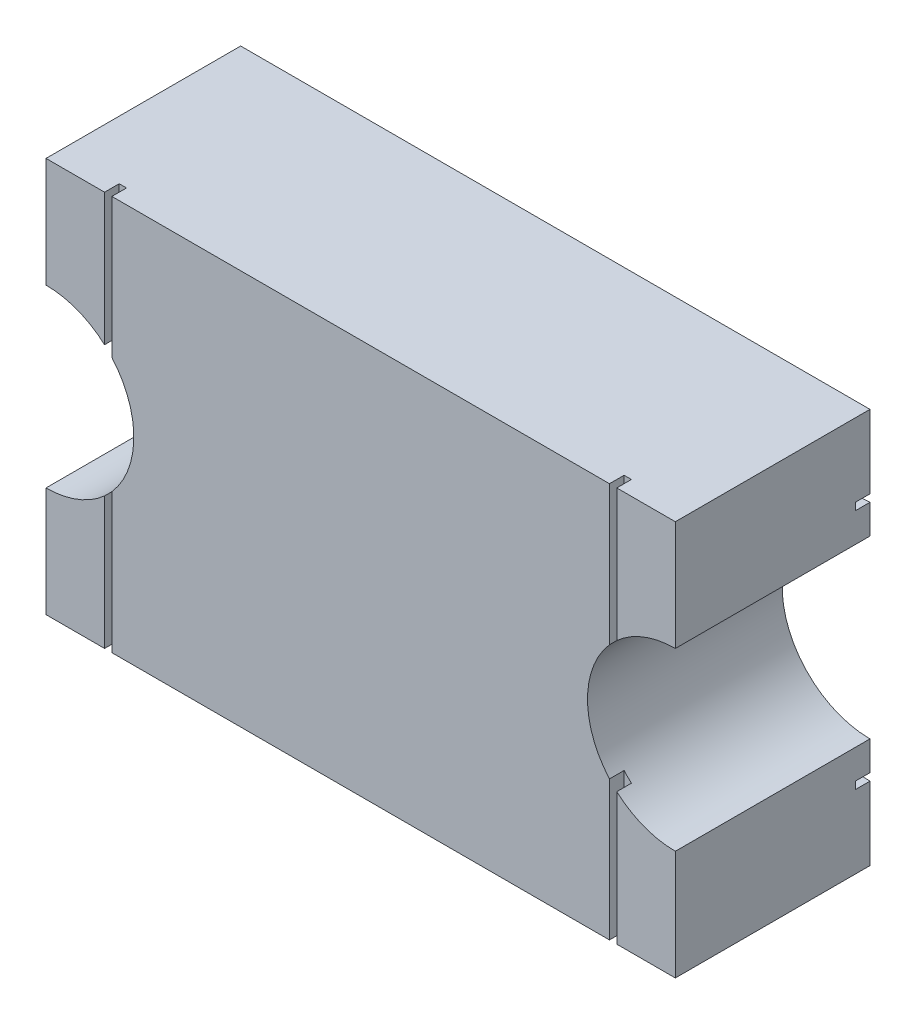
ISO-10303-21;
HEADER;
FILE_DESCRIPTION(('STEP AP214'),'2;1');
FILE_NAME('part.step','',(''),(''),'','','');
FILE_SCHEMA(('AUTOMOTIVE_DESIGN { 1 0 10303 214 1 1 1 1 }'));
ENDSEC;
DATA;
#1=APPLICATION_CONTEXT('core data for automotive mechanical design processes');
#2=APPLICATION_PROTOCOL_DEFINITION('international standard','automotive_design',2000,#1);
#3=PRODUCT_CONTEXT('',#1,'mechanical');
#4=PRODUCT('Part','Part','',(#3));
#5=PRODUCT_RELATED_PRODUCT_CATEGORY('part','',(#4));
#6=PRODUCT_DEFINITION_FORMATION('','',#4);
#7=PRODUCT_DEFINITION_CONTEXT('part definition',#1,'design');
#8=PRODUCT_DEFINITION('design','',#6,#7);
#9=PRODUCT_DEFINITION_SHAPE('','',#8);
#10=(LENGTH_UNIT() NAMED_UNIT(*) SI_UNIT(.MILLI.,.METRE.));
#11=(NAMED_UNIT(*) PLANE_ANGLE_UNIT() SI_UNIT($,.RADIAN.));
#12=(NAMED_UNIT(*) SI_UNIT($,.STERADIAN.) SOLID_ANGLE_UNIT());
#13=UNCERTAINTY_MEASURE_WITH_UNIT(LENGTH_MEASURE(1.E-05),#10,'distance_accuracy_value','');
#14=(GEOMETRIC_REPRESENTATION_CONTEXT(3) GLOBAL_UNCERTAINTY_ASSIGNED_CONTEXT((#13)) GLOBAL_UNIT_ASSIGNED_CONTEXT((#10,
#11,#12)) REPRESENTATION_CONTEXT('',''));
#15=CARTESIAN_POINT('',(0.,0.,0.));
#16=DIRECTION('',(0.,0.,1.));
#17=DIRECTION('',(1.,0.,0.));
#18=AXIS2_PLACEMENT_3D('',#15,#16,#17);
#19=CARTESIAN_POINT('',(0.000121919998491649,4.06399994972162E-05,0.));
#20=DIRECTION('',(0.,-4.37113882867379E-08,0.999999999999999));
#21=DIRECTION('',(0.999999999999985,1.74845553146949E-07,0.));
#22=AXIS2_PLACEMENT_3D('',#19,#20,#21);
#23=PLANE('',#22);
#24=DIRECTION('',(-1.74845553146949E-07,0.999999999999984,4.37113882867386E-08));
#25=VECTOR('',#24,1.);
#26=CARTESIAN_POINT('',(1.07512203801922,-0.674959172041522,-2.95051870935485E-08));
#27=LINE('',#26,#25);
#28=CARTESIAN_POINT('',(1.07512203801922,-0.674959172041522,-2.95051870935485E-08));
#29=VERTEX_POINT('',#28);
#30=CARTESIAN_POINT('',(1.07512199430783,-0.424959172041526,-1.85773400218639E-08));
#31=VERTEX_POINT('',#30);
#32=EDGE_CURVE('E11',#29,#31,#27,.T.);
#33=ORIENTED_EDGE('',*,*,#32,.F.);
#34=DIRECTION('',(0.999999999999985,1.74845553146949E-07,0.));
#35=VECTOR('',#34,1.);
#36=CARTESIAN_POINT('',(-1.07487796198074,-0.674959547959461,-2.95051870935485E-08));
#37=LINE('',#36,#35);
#38=CARTESIAN_POINT('',(-1.07487796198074,-0.674959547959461,-2.95051870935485E-08));
#39=VERTEX_POINT('',#38);
#40=EDGE_CURVE('E24',#39,#29,#37,.T.);
#41=ORIENTED_EDGE('',*,*,#40,.F.);
#42=DIRECTION('',(1.74845553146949E-07,-0.999999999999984,-4.37113882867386E-08));
#43=VECTOR('',#42,1.);
#44=CARTESIAN_POINT('',(-1.07487800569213,-0.424959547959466,-1.85773400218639E-08));
#45=LINE('',#44,#43);
#46=CARTESIAN_POINT('',(-1.07487800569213,-0.424959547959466,-1.85773400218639E-08));
#47=VERTEX_POINT('',#46);
#48=EDGE_CURVE('E477',#47,#39,#45,.T.);
#49=ORIENTED_EDGE('',*,*,#48,.F.);
#50=CARTESIAN_POINT('',(-1.07487808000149,4.04520405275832E-05,0.));
#51=DIRECTION('',(0.,4.37113882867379E-08,-0.999999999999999));
#52=DIRECTION('',(-1.74845553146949E-07,0.999999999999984,4.37113882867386E-08));
#53=AXIS2_PLACEMENT_3D('',#50,#51,#52);
#54=CIRCLE('',#53,0.425);
#55=CARTESIAN_POINT('',(-1.07487815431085,0.425040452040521,1.85773400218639E-08));
#56=VERTEX_POINT('',#55);
#57=EDGE_CURVE('E475',#56,#47,#54,.T.);
#58=ORIENTED_EDGE('',*,*,#57,.F.);
#59=DIRECTION('',(1.74845553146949E-07,-0.999999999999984,-4.37113882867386E-08));
#60=VECTOR('',#59,1.);
#61=CARTESIAN_POINT('',(-1.07487819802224,0.675040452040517,2.95051870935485E-08));
#62=LINE('',#61,#60);
#63=CARTESIAN_POINT('',(-1.07487819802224,0.675040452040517,2.95051870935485E-08));
#64=VERTEX_POINT('',#63);
#65=EDGE_CURVE('E472',#64,#56,#62,.T.);
#66=ORIENTED_EDGE('',*,*,#65,.F.);
#67=DIRECTION('',(-0.999999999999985,-1.74845553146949E-07,0.));
#68=VECTOR('',#67,1.);
#69=CARTESIAN_POINT('',(1.07512180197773,0.675040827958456,2.95051870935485E-08));
#70=LINE('',#69,#68);
#71=CARTESIAN_POINT('',(1.07512180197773,0.675040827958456,2.95051870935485E-08));
#72=VERTEX_POINT('',#71);
#73=EDGE_CURVE('E470',#72,#64,#70,.T.);
#74=ORIENTED_EDGE('',*,*,#73,.F.);
#75=DIRECTION('',(-1.74845553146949E-07,0.999999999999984,4.37113882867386E-08));
#76=VECTOR('',#75,1.);
#77=CARTESIAN_POINT('',(1.07512184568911,0.42504082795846,1.85773400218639E-08));
#78=LINE('',#77,#76);
#79=CARTESIAN_POINT('',(1.07512184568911,0.42504082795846,1.85773400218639E-08));
#80=VERTEX_POINT('',#79);
#81=EDGE_CURVE('E468',#80,#72,#78,.T.);
#82=ORIENTED_EDGE('',*,*,#81,.F.);
#83=CARTESIAN_POINT('',(1.07512191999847,4.08279584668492E-05,0.));
#84=DIRECTION('',(0.,4.37113882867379E-08,-0.999999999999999));
#85=DIRECTION('',(1.74845553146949E-07,-0.999999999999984,-4.37113882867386E-08));
#86=AXIS2_PLACEMENT_3D('',#83,#84,#85);
#87=CIRCLE('',#86,0.425);
#88=EDGE_CURVE('E37',#31,#80,#87,.T.);
#89=ORIENTED_EDGE('',*,*,#88,.F.);
#90=EDGE_LOOP('',(#33,#41,#49,#58,#66,#74,#82,#89));
#91=FACE_BOUND('',#90,.T.);
#92=ADVANCED_FACE('F17',(#91),#23,.F.);
#93=CARTESIAN_POINT('',(0.000121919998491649,4.06399994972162E-05,0.));
#94=DIRECTION('',(0.,-4.37113882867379E-08,0.999999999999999));
#95=DIRECTION('',(0.999999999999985,1.74845553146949E-07,0.));
#96=AXIS2_PLACEMENT_3D('',#93,#94,#95);
#97=PLANE('',#96);
#98=DIRECTION('',(-1.74845553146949E-07,0.999999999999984,4.37113882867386E-08));
#99=VECTOR('',#98,1.);
#100=CARTESIAN_POINT('',(1.07512186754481,0.300040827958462,1.31134164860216E-08));
#101=LINE('',#100,#99);
#102=CARTESIAN_POINT('',(1.07512186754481,0.300040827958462,1.31134164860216E-08));
#103=VERTEX_POINT('',#102);
#104=CARTESIAN_POINT('',(1.07512185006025,0.40004082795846,1.74845553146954E-08));
#105=VERTEX_POINT('',#104);
#106=EDGE_CURVE('E465',#103,#105,#101,.T.);
#107=ORIENTED_EDGE('',*,*,#106,.F.);
#108=CARTESIAN_POINT('',(1.07512191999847,4.08279584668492E-05,0.));
#109=DIRECTION('',(0.,4.37113882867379E-08,-0.999999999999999));
#110=DIRECTION('',(1.74845553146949E-07,-0.999999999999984,-4.37113882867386E-08));
#111=AXIS2_PLACEMENT_3D('',#108,#109,#110);
#112=CIRCLE('',#111,0.3);
#113=CARTESIAN_POINT('',(1.07512197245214,-0.299959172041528,-1.31134164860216E-08));
#114=VERTEX_POINT('',#113);
#115=EDGE_CURVE('E463',#114,#103,#112,.T.);
#116=ORIENTED_EDGE('',*,*,#115,.F.);
#117=DIRECTION('',(-1.74845553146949E-07,0.999999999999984,4.37113882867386E-08));
#118=VECTOR('',#117,1.);
#119=CARTESIAN_POINT('',(1.0751219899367,-0.399959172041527,-1.74845553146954E-08));
#120=LINE('',#119,#118);
#121=CARTESIAN_POINT('',(1.0751219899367,-0.399959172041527,-1.74845553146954E-08));
#122=VERTEX_POINT('',#121);
#123=EDGE_CURVE('E461',#122,#114,#120,.T.);
#124=ORIENTED_EDGE('',*,*,#123,.F.);
#125=CARTESIAN_POINT('',(1.07512191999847,4.08279584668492E-05,0.));
#126=DIRECTION('',(0.,4.37113882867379E-08,-0.999999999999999));
#127=DIRECTION('',(1.74845553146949E-07,-0.999999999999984,-4.37113882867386E-08));
#128=AXIS2_PLACEMENT_3D('',#125,#126,#127);
#129=CIRCLE('',#128,0.4);
#130=EDGE_CURVE('E458',#122,#105,#129,.T.);
#131=ORIENTED_EDGE('',*,*,#130,.T.);
#132=EDGE_LOOP('',(#107,#116,#124,#131));
#133=FACE_BOUND('',#132,.T.);
#134=ADVANCED_FACE('F587',(#133),#97,.F.);
#135=CARTESIAN_POINT('',(0.000121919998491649,4.06399994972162E-05,0.));
#136=DIRECTION('',(0.,-4.37113882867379E-08,0.999999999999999));
#137=DIRECTION('',(0.999999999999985,1.74845553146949E-07,0.));
#138=AXIS2_PLACEMENT_3D('',#135,#136,#137);
#139=PLANE('',#138);
#140=DIRECTION('',(1.74845553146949E-07,-0.999999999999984,-4.37113882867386E-08));
#141=VECTOR('',#140,1.);
#142=CARTESIAN_POINT('',(-1.07487802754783,-0.299959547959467,-1.31134164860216E-08));
#143=LINE('',#142,#141);
#144=CARTESIAN_POINT('',(-1.07487802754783,-0.299959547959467,-1.31134164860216E-08));
#145=VERTEX_POINT('',#144);
#146=CARTESIAN_POINT('',(-1.07487801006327,-0.399959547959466,-1.74845553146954E-08));
#147=VERTEX_POINT('',#146);
#148=EDGE_CURVE('E455',#145,#147,#143,.T.);
#149=ORIENTED_EDGE('',*,*,#148,.F.);
#150=CARTESIAN_POINT('',(-1.07487808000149,4.04520405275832E-05,0.));
#151=DIRECTION('',(0.,4.37113882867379E-08,-0.999999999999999));
#152=DIRECTION('',(-1.74845553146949E-07,0.999999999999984,4.37113882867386E-08));
#153=AXIS2_PLACEMENT_3D('',#150,#151,#152);
#154=CIRCLE('',#153,0.3);
#155=CARTESIAN_POINT('',(-1.07487813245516,0.300040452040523,1.31134164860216E-08));
#156=VERTEX_POINT('',#155);
#157=EDGE_CURVE('E453',#156,#145,#154,.T.);
#158=ORIENTED_EDGE('',*,*,#157,.F.);
#159=DIRECTION('',(1.74845553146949E-07,-0.999999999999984,-4.37113882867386E-08));
#160=VECTOR('',#159,1.);
#161=CARTESIAN_POINT('',(-1.07487814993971,0.400040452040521,1.74845553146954E-08));
#162=LINE('',#161,#160);
#163=CARTESIAN_POINT('',(-1.07487814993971,0.400040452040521,1.74845553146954E-08));
#164=VERTEX_POINT('',#163);
#165=EDGE_CURVE('E451',#164,#156,#162,.T.);
#166=ORIENTED_EDGE('',*,*,#165,.F.);
#167=CARTESIAN_POINT('',(-1.07487808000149,4.04520405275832E-05,0.));
#168=DIRECTION('',(0.,4.37113882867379E-08,-0.999999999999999));
#169=DIRECTION('',(-1.74845553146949E-07,0.999999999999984,4.37113882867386E-08));
#170=AXIS2_PLACEMENT_3D('',#167,#168,#169);
#171=CIRCLE('',#170,0.4);
#172=EDGE_CURVE('E449',#164,#147,#171,.T.);
#173=ORIENTED_EDGE('',*,*,#172,.T.);
#174=EDGE_LOOP('',(#149,#158,#166,#173));
#175=FACE_BOUND('',#174,.T.);
#176=ADVANCED_FACE('F501',(#175),#139,.F.);
#177=CARTESIAN_POINT('',(1.07512191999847,4.08279584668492E-05,0.));
#178=DIRECTION('',(0.,4.37113882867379E-08,-0.999999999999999));
#179=DIRECTION('',(0.999999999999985,1.74845553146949E-07,0.));
#180=AXIS2_PLACEMENT_3D('',#177,#178,#179);
#181=CYLINDRICAL_SURFACE('',#180,0.425);
#182=DIRECTION('',(0.,4.37113882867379E-08,-0.999999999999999));
#183=VECTOR('',#182,1.);
#184=CARTESIAN_POINT('',(1.07512184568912,0.425040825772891,0.05000001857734));
#185=LINE('',#184,#183);
#186=CARTESIAN_POINT('',(1.07512184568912,0.425040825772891,0.05000001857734));
#187=VERTEX_POINT('',#186);
#188=EDGE_CURVE('E446',#187,#80,#185,.T.);
#189=ORIENTED_EDGE('',*,*,#188,.F.);
#190=CARTESIAN_POINT('',(1.07512191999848,4.08257728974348E-05,0.05));
#191=DIRECTION('',(0.,4.37113882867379E-08,-0.999999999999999));
#192=DIRECTION('',(1.74845553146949E-07,-0.999999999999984,-4.37113882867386E-08));
#193=AXIS2_PLACEMENT_3D('',#190,#191,#192);
#194=CIRCLE('',#193,0.425);
#195=CARTESIAN_POINT('',(1.07512199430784,-0.424959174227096,0.0499999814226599));
#196=VERTEX_POINT('',#195);
#197=EDGE_CURVE('E443',#196,#187,#194,.T.);
#198=ORIENTED_EDGE('',*,*,#197,.F.);
#199=DIRECTION('',(0.,4.37113882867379E-08,-0.999999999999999));
#200=VECTOR('',#199,1.);
#201=CARTESIAN_POINT('',(1.07512199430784,-0.424959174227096,0.0499999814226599));
#202=LINE('',#201,#200);
#203=EDGE_CURVE('E440',#196,#31,#202,.T.);
#204=ORIENTED_EDGE('',*,*,#203,.T.);
#205=ORIENTED_EDGE('',*,*,#88,.T.);
#206=EDGE_LOOP('',(#189,#198,#204,#205));
#207=FACE_BOUND('',#206,.T.);
#208=ADVANCED_FACE('F563',(#207),#181,.F.);
#209=CARTESIAN_POINT('',(1.07512203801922,-0.674959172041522,-2.95051870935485E-08));
#210=DIRECTION('',(0.999999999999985,1.74845553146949E-07,0.));
#211=DIRECTION('',(-1.74845553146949E-07,0.999999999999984,4.37113882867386E-08));
#212=AXIS2_PLACEMENT_3D('',#209,#210,#211);
#213=PLANE('',#212);
#214=DIRECTION('',(0.,4.37113882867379E-08,-0.999999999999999));
#215=VECTOR('',#214,1.);
#216=CARTESIAN_POINT('',(1.0751219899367,-0.399959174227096,0.0499999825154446));
#217=LINE('',#216,#215);
#218=CARTESIAN_POINT('',(1.0751219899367,-0.399959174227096,0.0499999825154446));
#219=VERTEX_POINT('',#218);
#220=EDGE_CURVE('E437',#219,#122,#217,.T.);
#221=ORIENTED_EDGE('',*,*,#220,.T.);
#222=ORIENTED_EDGE('',*,*,#123,.T.);
#223=DIRECTION('',(0.,-4.37113882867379E-08,0.999999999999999));
#224=VECTOR('',#223,1.);
#225=CARTESIAN_POINT('',(1.07512197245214,-0.299959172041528,-1.31134164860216E-08));
#226=LINE('',#225,#224);
#227=CARTESIAN_POINT('',(1.07512197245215,-0.299959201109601,0.664999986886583));
#228=VERTEX_POINT('',#227);
#229=EDGE_CURVE('E434',#114,#228,#226,.T.);
#230=ORIENTED_EDGE('',*,*,#229,.T.);
#231=DIRECTION('',(-1.74845553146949E-07,0.999999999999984,4.37113882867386E-08));
#232=VECTOR('',#231,1.);
#233=CARTESIAN_POINT('',(1.07512203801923,-0.674959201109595,0.664999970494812));
#234=LINE('',#233,#232);
#235=CARTESIAN_POINT('',(1.07512203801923,-0.674959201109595,0.664999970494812));
#236=VERTEX_POINT('',#235);
#237=EDGE_CURVE('E431',#236,#228,#234,.T.);
#238=ORIENTED_EDGE('',*,*,#237,.F.);
#239=DIRECTION('',(0.,-4.37113882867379E-08,0.999999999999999));
#240=VECTOR('',#239,1.);
#241=CARTESIAN_POINT('',(1.07512203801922,-0.674959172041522,-2.95051870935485E-08));
#242=LINE('',#241,#240);
#243=EDGE_CURVE('E429',#29,#236,#242,.T.);
#244=ORIENTED_EDGE('',*,*,#243,.F.);
#245=ORIENTED_EDGE('',*,*,#32,.T.);
#246=ORIENTED_EDGE('',*,*,#203,.F.);
#247=DIRECTION('',(1.74845553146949E-07,-0.999999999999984,-4.37113882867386E-08));
#248=VECTOR('',#247,1.);
#249=CARTESIAN_POINT('',(1.0751219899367,-0.399959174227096,0.0499999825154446));
#250=LINE('',#249,#248);
#251=EDGE_CURVE('E427',#219,#196,#250,.T.);
#252=ORIENTED_EDGE('',*,*,#251,.F.);
#253=EDGE_LOOP('',(#221,#222,#230,#238,#244,#245,#246,#252));
#254=FACE_BOUND('',#253,.T.);
#255=ADVANCED_FACE('F569',(#254),#213,.T.);
#256=CARTESIAN_POINT('',(0.000121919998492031,4.06378139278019E-05,0.05));
#257=DIRECTION('',(0.,4.37113882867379E-08,-0.999999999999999));
#258=DIRECTION('',(0.999999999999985,1.74845553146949E-07,0.));
#259=AXIS2_PLACEMENT_3D('',#256,#257,#258);
#260=PLANE('',#259);
#261=CARTESIAN_POINT('',(-1.07487808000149,4.04498549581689E-05,0.05));
#262=DIRECTION('',(0.,4.37113882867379E-08,-0.999999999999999));
#263=DIRECTION('',(-1.74845553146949E-07,0.999999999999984,4.37113882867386E-08));
#264=AXIS2_PLACEMENT_3D('',#261,#262,#263);
#265=CIRCLE('',#264,0.425);
#266=CARTESIAN_POINT('',(-1.07487815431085,0.425040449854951,0.05000001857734));
#267=VERTEX_POINT('',#266);
#268=CARTESIAN_POINT('',(-1.07487800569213,-0.424959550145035,0.0499999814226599));
#269=VERTEX_POINT('',#268);
#270=EDGE_CURVE('E424',#267,#269,#265,.T.);
#271=ORIENTED_EDGE('',*,*,#270,.T.);
#272=DIRECTION('',(1.74845553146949E-07,-0.999999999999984,-4.37113882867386E-08));
#273=VECTOR('',#272,1.);
#274=CARTESIAN_POINT('',(-1.07487801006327,-0.399959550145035,0.0499999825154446));
#275=LINE('',#274,#273);
#276=CARTESIAN_POINT('',(-1.07487801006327,-0.399959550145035,0.0499999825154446));
#277=VERTEX_POINT('',#276);
#278=EDGE_CURVE('E422',#277,#269,#275,.T.);
#279=ORIENTED_EDGE('',*,*,#278,.F.);
#280=CARTESIAN_POINT('',(-1.07487808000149,4.04498549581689E-05,0.05));
#281=DIRECTION('',(0.,-4.37113882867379E-08,0.999999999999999));
#282=DIRECTION('',(1.74845553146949E-07,-0.999999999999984,-4.37113882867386E-08));
#283=AXIS2_PLACEMENT_3D('',#280,#281,#282);
#284=CIRCLE('',#283,0.4);
#285=CARTESIAN_POINT('',(-1.07487814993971,0.400040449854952,0.0500000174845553));
#286=VERTEX_POINT('',#285);
#287=EDGE_CURVE('E419',#277,#286,#284,.T.);
#288=ORIENTED_EDGE('',*,*,#287,.T.);
#289=DIRECTION('',(-1.74845553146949E-07,0.999999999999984,4.37113882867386E-08));
#290=VECTOR('',#289,1.);
#291=CARTESIAN_POINT('',(-1.07487814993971,0.400040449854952,0.0500000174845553));
#292=LINE('',#291,#290);
#293=EDGE_CURVE('E417',#286,#267,#292,.T.);
#294=ORIENTED_EDGE('',*,*,#293,.T.);
#295=EDGE_LOOP('',(#271,#279,#288,#294));
#296=FACE_BOUND('',#295,.T.);
#297=ADVANCED_FACE('F508',(#296),#260,.T.);
#298=CARTESIAN_POINT('',(0.000121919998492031,4.06378139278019E-05,0.05));
#299=DIRECTION('',(0.,4.37113882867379E-08,-0.999999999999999));
#300=DIRECTION('',(0.999999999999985,1.74845553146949E-07,0.));
#301=AXIS2_PLACEMENT_3D('',#298,#299,#300);
#302=PLANE('',#301);
#303=ORIENTED_EDGE('',*,*,#197,.T.);
#304=DIRECTION('',(-1.74845553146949E-07,0.999999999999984,4.37113882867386E-08));
#305=VECTOR('',#304,1.);
#306=CARTESIAN_POINT('',(1.07512185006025,0.400040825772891,0.0500000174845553));
#307=LINE('',#306,#305);
#308=CARTESIAN_POINT('',(1.07512185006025,0.400040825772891,0.0500000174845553));
#309=VERTEX_POINT('',#308);
#310=EDGE_CURVE('E414',#309,#187,#307,.T.);
#311=ORIENTED_EDGE('',*,*,#310,.F.);
#312=CARTESIAN_POINT('',(1.07512191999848,4.08257728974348E-05,0.05));
#313=DIRECTION('',(0.,-4.37113882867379E-08,0.999999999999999));
#314=DIRECTION('',(-1.74845553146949E-07,0.999999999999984,4.37113882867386E-08));
#315=AXIS2_PLACEMENT_3D('',#312,#313,#314);
#316=CIRCLE('',#315,0.4);
#317=EDGE_CURVE('E411',#309,#219,#316,.T.);
#318=ORIENTED_EDGE('',*,*,#317,.T.);
#319=ORIENTED_EDGE('',*,*,#251,.T.);
#320=EDGE_LOOP('',(#303,#311,#318,#319));
#321=FACE_BOUND('',#320,.T.);
#322=ADVANCED_FACE('F565',(#321),#302,.T.);
#323=CARTESIAN_POINT('',(-1.07487819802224,0.675040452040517,2.95051870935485E-08));
#324=DIRECTION('',(-0.999999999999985,-1.74845553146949E-07,0.));
#325=DIRECTION('',(1.74845553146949E-07,-0.999999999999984,-4.37113882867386E-08));
#326=AXIS2_PLACEMENT_3D('',#323,#324,#325);
#327=PLANE('',#326);
#328=DIRECTION('',(0.,4.37113882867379E-08,-0.999999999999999));
#329=VECTOR('',#328,1.);
#330=CARTESIAN_POINT('',(-1.07487814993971,0.400040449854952,0.0500000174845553));
#331=LINE('',#330,#329);
#332=EDGE_CURVE('E408',#286,#164,#331,.T.);
#333=ORIENTED_EDGE('',*,*,#332,.T.);
#334=ORIENTED_EDGE('',*,*,#165,.T.);
#335=DIRECTION('',(0.,-4.37113882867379E-08,0.999999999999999));
#336=VECTOR('',#335,1.);
#337=CARTESIAN_POINT('',(-1.07487813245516,0.300040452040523,1.31134164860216E-08));
#338=LINE('',#337,#336);
#339=CARTESIAN_POINT('',(-1.07487813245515,0.300040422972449,0.665000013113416));
#340=VERTEX_POINT('',#339);
#341=EDGE_CURVE('E405',#156,#340,#338,.T.);
#342=ORIENTED_EDGE('',*,*,#341,.T.);
#343=DIRECTION('',(1.74845553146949E-07,-0.999999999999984,-4.37113882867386E-08));
#344=VECTOR('',#343,1.);
#345=CARTESIAN_POINT('',(-1.07487819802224,0.675040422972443,0.665000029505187));
#346=LINE('',#345,#344);
#347=CARTESIAN_POINT('',(-1.07487819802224,0.675040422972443,0.665000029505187));
#348=VERTEX_POINT('',#347);
#349=EDGE_CURVE('E403',#348,#340,#346,.T.);
#350=ORIENTED_EDGE('',*,*,#349,.F.);
#351=DIRECTION('',(0.,-4.37113882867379E-08,0.999999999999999));
#352=VECTOR('',#351,1.);
#353=CARTESIAN_POINT('',(-1.07487819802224,0.675040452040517,2.95051870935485E-08));
#354=LINE('',#353,#352);
#355=EDGE_CURVE('E242',#64,#348,#354,.T.);
#356=ORIENTED_EDGE('',*,*,#355,.F.);
#357=ORIENTED_EDGE('',*,*,#65,.T.);
#358=DIRECTION('',(0.,4.37113882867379E-08,-0.999999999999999));
#359=VECTOR('',#358,1.);
#360=CARTESIAN_POINT('',(-1.07487815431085,0.425040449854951,0.05000001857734));
#361=LINE('',#360,#359);
#362=EDGE_CURVE('E400',#267,#56,#361,.T.);
#363=ORIENTED_EDGE('',*,*,#362,.F.);
#364=ORIENTED_EDGE('',*,*,#293,.F.);
#365=EDGE_LOOP('',(#333,#334,#342,#350,#356,#357,#363,#364));
#366=FACE_BOUND('',#365,.T.);
#367=ADVANCED_FACE('F516',(#366),#327,.T.);
#368=CARTESIAN_POINT('',(-1.07487808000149,4.04520405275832E-05,0.));
#369=DIRECTION('',(0.,4.37113882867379E-08,-0.999999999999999));
#370=DIRECTION('',(0.999999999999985,1.74845553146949E-07,0.));
#371=AXIS2_PLACEMENT_3D('',#368,#369,#370);
#372=CYLINDRICAL_SURFACE('',#371,0.425);
#373=DIRECTION('',(0.,4.37113882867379E-08,-0.999999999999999));
#374=VECTOR('',#373,1.);
#375=CARTESIAN_POINT('',(-1.07487800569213,-0.424959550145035,0.0499999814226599));
#376=LINE('',#375,#374);
#377=EDGE_CURVE('E397',#269,#47,#376,.T.);
#378=ORIENTED_EDGE('',*,*,#377,.F.);
#379=ORIENTED_EDGE('',*,*,#270,.F.);
#380=ORIENTED_EDGE('',*,*,#362,.T.);
#381=ORIENTED_EDGE('',*,*,#57,.T.);
#382=EDGE_LOOP('',(#378,#379,#380,#381));
#383=FACE_BOUND('',#382,.T.);
#384=ADVANCED_FACE('F511',(#383),#372,.F.);
#385=CARTESIAN_POINT('',(-1.07487802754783,-0.299959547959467,-1.31134164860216E-08));
#386=DIRECTION('',(-0.999999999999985,-1.74845553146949E-07,0.));
#387=DIRECTION('',(1.74845553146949E-07,-0.999999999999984,-4.37113882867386E-08));
#388=AXIS2_PLACEMENT_3D('',#385,#386,#387);
#389=PLANE('',#388);
#390=ORIENTED_EDGE('',*,*,#377,.T.);
#391=ORIENTED_EDGE('',*,*,#48,.T.);
#392=DIRECTION('',(0.,-4.37113882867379E-08,0.999999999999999));
#393=VECTOR('',#392,1.);
#394=CARTESIAN_POINT('',(-1.07487796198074,-0.674959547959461,-2.95051870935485E-08));
#395=LINE('',#394,#393);
#396=CARTESIAN_POINT('',(-1.07487796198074,-0.674959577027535,0.664999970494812));
#397=VERTEX_POINT('',#396);
#398=EDGE_CURVE('E394',#39,#397,#395,.T.);
#399=ORIENTED_EDGE('',*,*,#398,.T.);
#400=DIRECTION('',(1.74845553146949E-07,-0.999999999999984,-4.37113882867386E-08));
#401=VECTOR('',#400,1.);
#402=CARTESIAN_POINT('',(-1.07487802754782,-0.299959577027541,0.664999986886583));
#403=LINE('',#402,#401);
#404=CARTESIAN_POINT('',(-1.07487802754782,-0.299959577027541,0.664999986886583));
#405=VERTEX_POINT('',#404);
#406=EDGE_CURVE('E391',#405,#397,#403,.T.);
#407=ORIENTED_EDGE('',*,*,#406,.F.);
#408=DIRECTION('',(0.,-4.37113882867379E-08,0.999999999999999));
#409=VECTOR('',#408,1.);
#410=CARTESIAN_POINT('',(-1.07487802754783,-0.299959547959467,-1.31134164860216E-08));
#411=LINE('',#410,#409);
#412=EDGE_CURVE('E389',#145,#405,#411,.T.);
#413=ORIENTED_EDGE('',*,*,#412,.F.);
#414=ORIENTED_EDGE('',*,*,#148,.T.);
#415=DIRECTION('',(0.,4.37113882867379E-08,-0.999999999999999));
#416=VECTOR('',#415,1.);
#417=CARTESIAN_POINT('',(-1.07487801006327,-0.399959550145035,0.0499999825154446));
#418=LINE('',#417,#416);
#419=EDGE_CURVE('E386',#277,#147,#418,.T.);
#420=ORIENTED_EDGE('',*,*,#419,.F.);
#421=ORIENTED_EDGE('',*,*,#278,.T.);
#422=EDGE_LOOP('',(#390,#391,#399,#407,#413,#414,#420,#421));
#423=FACE_BOUND('',#422,.T.);
#424=ADVANCED_FACE('F481',(#423),#389,.T.);
#425=CARTESIAN_POINT('',(-1.07487808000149,4.04520405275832E-05,0.));
#426=DIRECTION('',(0.,4.37113882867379E-08,-0.999999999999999));
#427=DIRECTION('',(0.999999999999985,1.74845553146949E-07,0.));
#428=AXIS2_PLACEMENT_3D('',#425,#426,#427);
#429=CYLINDRICAL_SURFACE('',#428,0.4);
#430=ORIENTED_EDGE('',*,*,#332,.F.);
#431=ORIENTED_EDGE('',*,*,#287,.F.);
#432=ORIENTED_EDGE('',*,*,#419,.T.);
#433=ORIENTED_EDGE('',*,*,#172,.F.);
#434=EDGE_LOOP('',(#430,#431,#432,#433));
#435=FACE_BOUND('',#434,.T.);
#436=ADVANCED_FACE('F504',(#435),#429,.T.);
#437=CARTESIAN_POINT('',(-1.07487808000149,4.04520405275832E-05,0.));
#438=DIRECTION('',(0.,-4.37113882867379E-08,0.999999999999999));
#439=DIRECTION('',(0.999999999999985,1.74845553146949E-07,0.));
#440=AXIS2_PLACEMENT_3D('',#437,#438,#439);
#441=CYLINDRICAL_SURFACE('',#440,0.3);
#442=DIRECTION('',(0.,-4.37114032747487E-08,0.999999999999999));
#443=VECTOR('',#442,1.);
#444=CARTESIAN_POINT('',(-0.849878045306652,-0.198390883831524,0.61499999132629));
#445=LINE('',#444,#443);
#446=CARTESIAN_POINT('',(-0.849878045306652,-0.198390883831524,0.61499999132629));
#447=VERTEX_POINT('',#446);
#448=CARTESIAN_POINT('',(-0.849878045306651,-0.198390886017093,0.66499999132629));
#449=VERTEX_POINT('',#448);
#450=EDGE_CURVE('E384',#447,#449,#445,.T.);
#451=ORIENTED_EDGE('',*,*,#450,.T.);
#452=CARTESIAN_POINT('',(-1.07487808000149,4.04229724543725E-05,0.664999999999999));
#453=DIRECTION('',(0.,4.37113882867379E-08,-0.999999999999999));
#454=DIRECTION('',(0.7499998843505,0.661437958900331,2.89123657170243E-08));
#455=AXIS2_PLACEMENT_3D('',#452,#453,#454);
#456=CIRCLE('',#455,0.3);
#457=CARTESIAN_POINT('',(-0.849878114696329,0.198471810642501,0.665000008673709));
#458=VERTEX_POINT('',#457);
#459=EDGE_CURVE('E381',#458,#449,#456,.T.);
#460=ORIENTED_EDGE('',*,*,#459,.F.);
#461=DIRECTION('',(0.,-4.37113716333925E-08,0.999999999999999));
#462=VECTOR('',#461,1.);
#463=CARTESIAN_POINT('',(-0.84987811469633,0.19847181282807,0.615000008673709));
#464=LINE('',#463,#462);
#465=CARTESIAN_POINT('',(-0.84987811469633,0.19847181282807,0.615000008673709));
#466=VERTEX_POINT('',#465);
#467=EDGE_CURVE('E378',#466,#458,#464,.T.);
#468=ORIENTED_EDGE('',*,*,#467,.F.);
#469=CARTESIAN_POINT('',(-1.07487808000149,4.04251580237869E-05,0.614999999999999));
#470=DIRECTION('',(0.,-4.37113882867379E-08,0.999999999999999));
#471=DIRECTION('',(0.749999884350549,0.661437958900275,2.89123657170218E-08));
#472=AXIS2_PLACEMENT_3D('',#469,#470,#471);
#473=CIRCLE('',#472,0.3);
#474=CARTESIAN_POINT('',(-0.874878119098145,0.223647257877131,0.615000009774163));
#475=VERTEX_POINT('',#474);
#476=EDGE_CURVE('E375',#466,#475,#473,.T.);
#477=ORIENTED_EDGE('',*,*,#476,.T.);
#478=DIRECTION('',(0.,-4.37113882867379E-08,0.999999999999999));
#479=VECTOR('',#478,1.);
#480=CARTESIAN_POINT('',(-0.874878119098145,0.223647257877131,0.615000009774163));
#481=LINE('',#480,#479);
#482=CARTESIAN_POINT('',(-0.874878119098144,0.223647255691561,0.665000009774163));
#483=VERTEX_POINT('',#482);
#484=EDGE_CURVE('E373',#475,#483,#481,.T.);
#485=ORIENTED_EDGE('',*,*,#484,.T.);
#486=CARTESIAN_POINT('',(-1.07487808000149,4.04229724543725E-05,0.664999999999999));
#487=DIRECTION('',(0.,4.37113882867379E-08,-0.999999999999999));
#488=DIRECTION('',(-1.74845553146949E-07,0.999999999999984,4.37113882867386E-08));
#489=AXIS2_PLACEMENT_3D('',#486,#487,#488);
#490=CIRCLE('',#489,0.3);
#491=EDGE_CURVE('E229',#340,#483,#490,.T.);
#492=ORIENTED_EDGE('',*,*,#491,.F.);
#493=ORIENTED_EDGE('',*,*,#341,.F.);
#494=ORIENTED_EDGE('',*,*,#157,.T.);
#495=ORIENTED_EDGE('',*,*,#412,.T.);
#496=CARTESIAN_POINT('',(-1.07487808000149,4.04229724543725E-05,0.664999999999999));
#497=DIRECTION('',(0.,4.37113882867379E-08,-0.999999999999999));
#498=DIRECTION('',(0.666666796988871,-0.745355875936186,-3.25805452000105E-08));
#499=AXIS2_PLACEMENT_3D('',#496,#497,#498);
#500=CIRCLE('',#499,0.3);
#501=CARTESIAN_POINT('',(-0.874878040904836,-0.223566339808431,0.664999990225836));
#502=VERTEX_POINT('',#501);
#503=EDGE_CURVE('E369',#502,#405,#500,.T.);
#504=ORIENTED_EDGE('',*,*,#503,.F.);
#505=DIRECTION('',(0.,-4.37113882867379E-08,0.999999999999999));
#506=VECTOR('',#505,1.);
#507=CARTESIAN_POINT('',(-0.874878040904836,-0.223566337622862,0.614999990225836));
#508=LINE('',#507,#506);
#509=CARTESIAN_POINT('',(-0.874878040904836,-0.223566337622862,0.614999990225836));
#510=VERTEX_POINT('',#509);
#511=EDGE_CURVE('E366',#510,#502,#508,.T.);
#512=ORIENTED_EDGE('',*,*,#511,.F.);
#513=CARTESIAN_POINT('',(-1.07487808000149,4.04251580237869E-05,0.614999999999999));
#514=DIRECTION('',(0.,-4.37113882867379E-08,0.999999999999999));
#515=DIRECTION('',(0.666666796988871,-0.745355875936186,-3.25805452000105E-08));
#516=AXIS2_PLACEMENT_3D('',#513,#514,#515);
#517=CIRCLE('',#516,0.3);
#518=EDGE_CURVE('E363',#510,#447,#517,.T.);
#519=ORIENTED_EDGE('',*,*,#518,.T.);
#520=EDGE_LOOP('',(#451,#460,#468,#477,#485,#492,#493,#494,#495,#504,#512,#519));
#521=FACE_BOUND('',#520,.T.);
#522=ADVANCED_FACE('F495',(#521),#441,.F.);
#523=CARTESIAN_POINT('',(0.000121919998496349,4.06131169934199E-05,0.614999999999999));
#524=DIRECTION('',(0.,-4.37113882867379E-08,0.999999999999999));
#525=DIRECTION('',(0.999999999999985,1.74845553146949E-07,0.));
#526=AXIS2_PLACEMENT_3D('',#523,#524,#525);
#527=PLANE('',#526);
#528=DIRECTION('',(1.74845553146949E-07,-0.999999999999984,-4.37113882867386E-08));
#529=VECTOR('',#528,1.);
#530=CARTESIAN_POINT('',(-0.874878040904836,-0.223566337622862,0.614999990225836));
#531=LINE('',#530,#529);
#532=CARTESIAN_POINT('',(-0.874877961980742,-0.674959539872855,0.614999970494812));
#533=VERTEX_POINT('',#532);
#534=EDGE_CURVE('E361',#510,#533,#531,.T.);
#535=ORIENTED_EDGE('',*,*,#534,.T.);
#536=DIRECTION('',(0.999999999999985,1.74845553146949E-07,0.));
#537=VECTOR('',#536,1.);
#538=CARTESIAN_POINT('',(-0.874877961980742,-0.674959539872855,0.614999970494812));
#539=LINE('',#538,#537);
#540=CARTESIAN_POINT('',(-0.849877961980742,-0.674959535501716,0.614999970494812));
#541=VERTEX_POINT('',#540);
#542=EDGE_CURVE('E358',#533,#541,#539,.T.);
#543=ORIENTED_EDGE('',*,*,#542,.T.);
#544=DIRECTION('',(-1.74845553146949E-07,0.999999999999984,4.37113882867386E-08));
#545=VECTOR('',#544,1.);
#546=CARTESIAN_POINT('',(-0.849877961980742,-0.674959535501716,0.614999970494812));
#547=LINE('',#546,#545);
#548=EDGE_CURVE('E355',#541,#447,#547,.T.);
#549=ORIENTED_EDGE('',*,*,#548,.T.);
#550=ORIENTED_EDGE('',*,*,#518,.F.);
#551=EDGE_LOOP('',(#535,#543,#549,#550));
#552=FACE_BOUND('',#551,.T.);
#553=ADVANCED_FACE('F625',(#552),#527,.T.);
#554=CARTESIAN_POINT('',(0.000121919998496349,4.06131169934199E-05,0.614999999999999));
#555=DIRECTION('',(0.,-4.37113882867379E-08,0.999999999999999));
#556=DIRECTION('',(0.999999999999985,1.74845553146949E-07,0.));
#557=AXIS2_PLACEMENT_3D('',#554,#555,#556);
#558=PLANE('',#557);
#559=DIRECTION('',(-1.74845553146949E-07,0.999999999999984,4.37113882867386E-08));
#560=VECTOR('',#559,1.);
#561=CARTESIAN_POINT('',(-0.84987811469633,0.19847181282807,0.615000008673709));
#562=LINE('',#561,#560);
#563=CARTESIAN_POINT('',(-0.849878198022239,0.675040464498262,0.615000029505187));
#564=VERTEX_POINT('',#563);
#565=EDGE_CURVE('E353',#466,#564,#562,.T.);
#566=ORIENTED_EDGE('',*,*,#565,.T.);
#567=DIRECTION('',(0.999999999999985,1.74845553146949E-07,0.));
#568=VECTOR('',#567,1.);
#569=CARTESIAN_POINT('',(-0.874878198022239,0.675040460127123,0.615000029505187));
#570=LINE('',#569,#568);
#571=CARTESIAN_POINT('',(-0.874878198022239,0.675040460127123,0.615000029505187));
#572=VERTEX_POINT('',#571);
#573=EDGE_CURVE('E351',#572,#564,#570,.T.);
#574=ORIENTED_EDGE('',*,*,#573,.F.);
#575=DIRECTION('',(1.74845553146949E-07,-0.999999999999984,-4.37113882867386E-08));
#576=VECTOR('',#575,1.);
#577=CARTESIAN_POINT('',(-0.874878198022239,0.675040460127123,0.615000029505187));
#578=LINE('',#577,#576);
#579=EDGE_CURVE('E247',#572,#475,#578,.T.);
#580=ORIENTED_EDGE('',*,*,#579,.T.);
#581=ORIENTED_EDGE('',*,*,#476,.F.);
#582=EDGE_LOOP('',(#566,#574,#580,#581));
#583=FACE_BOUND('',#582,.T.);
#584=ADVANCED_FACE('F521',(#583),#558,.T.);
#585=CARTESIAN_POINT('',(0.000121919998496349,4.06131169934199E-05,0.614999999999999));
#586=DIRECTION('',(0.,-4.37113882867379E-08,0.999999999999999));
#587=DIRECTION('',(0.999999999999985,1.74845553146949E-07,0.));
#588=AXIS2_PLACEMENT_3D('',#585,#586,#587);
#589=PLANE('',#588);
#590=DIRECTION('',(-1.74845553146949E-07,0.999999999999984,4.37113882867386E-08));
#591=VECTOR('',#590,1.);
#592=CARTESIAN_POINT('',(0.875122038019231,-0.674959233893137,0.614999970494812));
#593=LINE('',#592,#591);
#594=CARTESIAN_POINT('',(0.875122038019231,-0.674959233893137,0.614999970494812));
#595=VERTEX_POINT('',#594);
#596=CARTESIAN_POINT('',(0.875121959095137,-0.223566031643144,0.614999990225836));
#597=VERTEX_POINT('',#596);
#598=EDGE_CURVE('E347',#595,#597,#593,.T.);
#599=ORIENTED_EDGE('',*,*,#598,.T.);
#600=CARTESIAN_POINT('',(1.07512191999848,4.08010759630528E-05,0.614999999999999));
#601=DIRECTION('',(0.,-4.37113882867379E-08,0.999999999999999));
#602=DIRECTION('',(-0.749999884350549,-0.661437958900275,-2.89123657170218E-08));
#603=AXIS2_PLACEMENT_3D('',#600,#601,#602);
#604=CIRCLE('',#603,0.3);
#605=CARTESIAN_POINT('',(0.850121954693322,-0.198390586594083,0.61499999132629));
#606=VERTEX_POINT('',#605);
#607=EDGE_CURVE('E345',#606,#597,#604,.T.);
#608=ORIENTED_EDGE('',*,*,#607,.F.);
#609=DIRECTION('',(1.74845553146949E-07,-0.999999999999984,-4.37113882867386E-08));
#610=VECTOR('',#609,1.);
#611=CARTESIAN_POINT('',(0.850121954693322,-0.198390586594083,0.61499999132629));
#612=LINE('',#611,#610);
#613=CARTESIAN_POINT('',(0.850122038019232,-0.674959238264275,0.614999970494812));
#614=VERTEX_POINT('',#613);
#615=EDGE_CURVE('E342',#606,#614,#612,.T.);
#616=ORIENTED_EDGE('',*,*,#615,.T.);
#617=DIRECTION('',(0.999999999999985,1.74845553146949E-07,0.));
#618=VECTOR('',#617,1.);
#619=CARTESIAN_POINT('',(0.850122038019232,-0.674959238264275,0.614999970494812));
#620=LINE('',#619,#618);
#621=EDGE_CURVE('E340',#614,#595,#620,.T.);
#622=ORIENTED_EDGE('',*,*,#621,.T.);
#623=EDGE_LOOP('',(#599,#608,#616,#622));
#624=FACE_BOUND('',#623,.T.);
#625=ADVANCED_FACE('F581',(#624),#589,.T.);
#626=CARTESIAN_POINT('',(0.000121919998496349,4.06131169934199E-05,0.614999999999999));
#627=DIRECTION('',(0.,-4.37113882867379E-08,0.999999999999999));
#628=DIRECTION('',(0.999999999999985,1.74845553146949E-07,0.));
#629=AXIS2_PLACEMENT_3D('',#626,#627,#628);
#630=PLANE('',#629);
#631=DIRECTION('',(-1.74845553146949E-07,0.999999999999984,4.37113882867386E-08));
#632=VECTOR('',#631,1.);
#633=CARTESIAN_POINT('',(0.875121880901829,0.223647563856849,0.615000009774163));
#634=LINE('',#633,#632);
#635=CARTESIAN_POINT('',(0.875121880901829,0.223647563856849,0.615000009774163));
#636=VERTEX_POINT('',#635);
#637=CARTESIAN_POINT('',(0.875121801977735,0.675040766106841,0.615000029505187));
#638=VERTEX_POINT('',#637);
#639=EDGE_CURVE('E337',#636,#638,#634,.T.);
#640=ORIENTED_EDGE('',*,*,#639,.T.);
#641=DIRECTION('',(0.999999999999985,1.74845553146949E-07,0.));
#642=VECTOR('',#641,1.);
#643=CARTESIAN_POINT('',(0.850121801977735,0.675040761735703,0.615000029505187));
#644=LINE('',#643,#642);
#645=CARTESIAN_POINT('',(0.850121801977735,0.675040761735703,0.615000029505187));
#646=VERTEX_POINT('',#645);
#647=EDGE_CURVE('E335',#646,#638,#644,.T.);
#648=ORIENTED_EDGE('',*,*,#647,.F.);
#649=DIRECTION('',(1.74845553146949E-07,-0.999999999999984,-4.37113882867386E-08));
#650=VECTOR('',#649,1.);
#651=CARTESIAN_POINT('',(0.850121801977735,0.675040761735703,0.615000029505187));
#652=LINE('',#651,#650);
#653=CARTESIAN_POINT('',(0.850121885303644,0.19847211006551,0.615000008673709));
#654=VERTEX_POINT('',#653);
#655=EDGE_CURVE('E333',#646,#654,#652,.T.);
#656=ORIENTED_EDGE('',*,*,#655,.T.);
#657=CARTESIAN_POINT('',(1.07512191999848,4.08010759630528E-05,0.614999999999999));
#658=DIRECTION('',(0.,-4.37113882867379E-08,0.999999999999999));
#659=DIRECTION('',(-0.666666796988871,0.745355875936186,3.25805452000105E-08));
#660=AXIS2_PLACEMENT_3D('',#657,#658,#659);
#661=CIRCLE('',#660,0.3);
#662=EDGE_CURVE('E330',#636,#654,#661,.T.);
#663=ORIENTED_EDGE('',*,*,#662,.F.);
#664=EDGE_LOOP('',(#640,#648,#656,#663));
#665=FACE_BOUND('',#664,.T.);
#666=ADVANCED_FACE('F548',(#665),#630,.T.);
#667=CARTESIAN_POINT('',(-0.849877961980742,-0.674959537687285,0.664999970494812));
#668=DIRECTION('',(0.999999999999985,1.74845553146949E-07,0.));
#669=DIRECTION('',(-1.74845553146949E-07,0.999999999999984,4.37113882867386E-08));
#670=AXIS2_PLACEMENT_3D('',#667,#668,#669);
#671=PLANE('',#670);
#672=ORIENTED_EDGE('',*,*,#450,.F.);
#673=ORIENTED_EDGE('',*,*,#548,.F.);
#674=DIRECTION('',(0.,4.37113882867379E-08,-0.999999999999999));
#675=VECTOR('',#674,1.);
#676=CARTESIAN_POINT('',(-0.849877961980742,-0.674959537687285,0.664999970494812));
#677=LINE('',#676,#675);
#678=CARTESIAN_POINT('',(-0.849877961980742,-0.674959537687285,0.664999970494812));
#679=VERTEX_POINT('',#678);
#680=EDGE_CURVE('E327',#679,#541,#677,.T.);
#681=ORIENTED_EDGE('',*,*,#680,.F.);
#682=DIRECTION('',(-1.74845553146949E-07,0.999999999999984,4.37113882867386E-08));
#683=VECTOR('',#682,1.);
#684=CARTESIAN_POINT('',(-0.849877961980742,-0.674959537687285,0.664999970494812));
#685=LINE('',#684,#683);
#686=EDGE_CURVE('E324',#679,#449,#685,.T.);
#687=ORIENTED_EDGE('',*,*,#686,.T.);
#688=EDGE_LOOP('',(#672,#673,#681,#687));
#689=FACE_BOUND('',#688,.T.);
#690=ADVANCED_FACE('F531',(#689),#671,.F.);
#691=CARTESIAN_POINT('',(-0.849877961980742,-0.674959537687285,0.664999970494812));
#692=DIRECTION('',(0.999999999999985,1.74845553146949E-07,0.));
#693=DIRECTION('',(-1.74845553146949E-07,0.999999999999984,4.37113882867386E-08));
#694=AXIS2_PLACEMENT_3D('',#691,#692,#693);
#695=PLANE('',#694);
#696=DIRECTION('',(0.,4.37113882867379E-08,-0.999999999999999));
#697=VECTOR('',#696,1.);
#698=CARTESIAN_POINT('',(-0.849878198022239,0.675040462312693,0.665000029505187));
#699=LINE('',#698,#697);
#700=CARTESIAN_POINT('',(-0.849878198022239,0.675040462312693,0.665000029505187));
#701=VERTEX_POINT('',#700);
#702=EDGE_CURVE('E321',#701,#564,#699,.T.);
#703=ORIENTED_EDGE('',*,*,#702,.T.);
#704=ORIENTED_EDGE('',*,*,#565,.F.);
#705=ORIENTED_EDGE('',*,*,#467,.T.);
#706=DIRECTION('',(-1.74845553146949E-07,0.999999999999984,4.37113882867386E-08));
#707=VECTOR('',#706,1.);
#708=CARTESIAN_POINT('',(-0.849878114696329,0.198471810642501,0.665000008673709));
#709=LINE('',#708,#707);
#710=EDGE_CURVE('E318',#458,#701,#709,.T.);
#711=ORIENTED_EDGE('',*,*,#710,.T.);
#712=EDGE_LOOP('',(#703,#704,#705,#711));
#713=FACE_BOUND('',#712,.T.);
#714=ADVANCED_FACE('F527',(#713),#695,.F.);
#715=CARTESIAN_POINT('',(0.000121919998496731,4.06109314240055E-05,0.664999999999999));
#716=DIRECTION('',(0.,-4.37113882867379E-08,0.999999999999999));
#717=DIRECTION('',(0.999999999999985,1.74845553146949E-07,0.));
#718=AXIS2_PLACEMENT_3D('',#715,#716,#717);
#719=PLANE('',#718);
#720=CARTESIAN_POINT('',(1.07512191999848,4.07988903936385E-05,0.664999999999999));
#721=DIRECTION('',(0.,4.37113882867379E-08,-0.999999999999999));
#722=DIRECTION('',(-0.7499998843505,-0.661437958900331,-2.89123657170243E-08));
#723=AXIS2_PLACEMENT_3D('',#720,#721,#722);
#724=CIRCLE('',#723,0.3);
#725=CARTESIAN_POINT('',(0.850121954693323,-0.198390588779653,0.66499999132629));
#726=VERTEX_POINT('',#725);
#727=CARTESIAN_POINT('',(0.850121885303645,0.198472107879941,0.665000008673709));
#728=VERTEX_POINT('',#727);
#729=EDGE_CURVE('E315',#726,#728,#724,.T.);
#730=ORIENTED_EDGE('',*,*,#729,.T.);
#731=DIRECTION('',(-1.74845553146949E-07,0.999999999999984,4.37113882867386E-08));
#732=VECTOR('',#731,1.);
#733=CARTESIAN_POINT('',(0.850121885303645,0.198472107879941,0.665000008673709));
#734=LINE('',#733,#732);
#735=CARTESIAN_POINT('',(0.850121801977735,0.675040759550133,0.665000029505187));
#736=VERTEX_POINT('',#735);
#737=EDGE_CURVE('E312',#728,#736,#734,.T.);
#738=ORIENTED_EDGE('',*,*,#737,.T.);
#739=DIRECTION('',(-0.999999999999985,-1.74845553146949E-07,0.));
#740=VECTOR('',#739,1.);
#741=CARTESIAN_POINT('',(0.850121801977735,0.675040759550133,0.665000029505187));
#742=LINE('',#741,#740);
#743=EDGE_CURVE('E309',#736,#701,#742,.T.);
#744=ORIENTED_EDGE('',*,*,#743,.T.);
#745=ORIENTED_EDGE('',*,*,#710,.F.);
#746=ORIENTED_EDGE('',*,*,#459,.T.);
#747=ORIENTED_EDGE('',*,*,#686,.F.);
#748=DIRECTION('',(0.999999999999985,1.74845553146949E-07,0.));
#749=VECTOR('',#748,1.);
#750=CARTESIAN_POINT('',(-0.849877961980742,-0.674959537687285,0.664999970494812));
#751=LINE('',#750,#749);
#752=CARTESIAN_POINT('',(0.850122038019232,-0.674959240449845,0.664999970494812));
#753=VERTEX_POINT('',#752);
#754=EDGE_CURVE('E306',#679,#753,#751,.T.);
#755=ORIENTED_EDGE('',*,*,#754,.T.);
#756=DIRECTION('',(-1.74845553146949E-07,0.999999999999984,4.37113882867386E-08));
#757=VECTOR('',#756,1.);
#758=CARTESIAN_POINT('',(0.850122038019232,-0.674959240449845,0.664999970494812));
#759=LINE('',#758,#757);
#760=EDGE_CURVE('E304',#753,#726,#759,.T.);
#761=ORIENTED_EDGE('',*,*,#760,.T.);
#762=EDGE_LOOP('',(#730,#738,#744,#745,#746,#747,#755,#761));
#763=FACE_BOUND('',#762,.T.);
#764=ADVANCED_FACE('F525',(#763),#719,.T.);
#765=CARTESIAN_POINT('',(0.000121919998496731,4.06109314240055E-05,0.664999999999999));
#766=DIRECTION('',(0.,-4.37113882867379E-08,0.999999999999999));
#767=DIRECTION('',(0.999999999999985,1.74845553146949E-07,0.));
#768=AXIS2_PLACEMENT_3D('',#765,#766,#767);
#769=PLANE('',#768);
#770=DIRECTION('',(0.999999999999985,1.74845553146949E-07,0.));
#771=VECTOR('',#770,1.);
#772=CARTESIAN_POINT('',(0.875122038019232,-0.674959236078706,0.664999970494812));
#773=LINE('',#772,#771);
#774=CARTESIAN_POINT('',(0.875122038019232,-0.674959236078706,0.664999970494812));
#775=VERTEX_POINT('',#774);
#776=EDGE_CURVE('E302',#775,#236,#773,.T.);
#777=ORIENTED_EDGE('',*,*,#776,.T.);
#778=ORIENTED_EDGE('',*,*,#237,.T.);
#779=CARTESIAN_POINT('',(1.07512191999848,4.07988903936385E-05,0.664999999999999));
#780=DIRECTION('',(0.,4.37113882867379E-08,-0.999999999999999));
#781=DIRECTION('',(1.74845553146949E-07,-0.999999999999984,-4.37113882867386E-08));
#782=AXIS2_PLACEMENT_3D('',#779,#780,#781);
#783=CIRCLE('',#782,0.3);
#784=CARTESIAN_POINT('',(0.875121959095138,-0.223566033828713,0.664999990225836));
#785=VERTEX_POINT('',#784);
#786=EDGE_CURVE('E299',#228,#785,#783,.T.);
#787=ORIENTED_EDGE('',*,*,#786,.T.);
#788=DIRECTION('',(-1.74845553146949E-07,0.999999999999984,4.37113882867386E-08));
#789=VECTOR('',#788,1.);
#790=CARTESIAN_POINT('',(0.875122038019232,-0.674959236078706,0.664999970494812));
#791=LINE('',#790,#789);
#792=EDGE_CURVE('E297',#775,#785,#791,.T.);
#793=ORIENTED_EDGE('',*,*,#792,.F.);
#794=EDGE_LOOP('',(#777,#778,#787,#793));
#795=FACE_BOUND('',#794,.T.);
#796=ADVANCED_FACE('F576',(#795),#769,.T.);
#797=CARTESIAN_POINT('',(0.000121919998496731,4.06109314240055E-05,0.664999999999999));
#798=DIRECTION('',(0.,-4.37113882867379E-08,0.999999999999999));
#799=DIRECTION('',(0.999999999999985,1.74845553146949E-07,0.));
#800=AXIS2_PLACEMENT_3D('',#797,#798,#799);
#801=PLANE('',#800);
#802=CARTESIAN_POINT('',(1.07512191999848,4.07988903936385E-05,0.664999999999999));
#803=DIRECTION('',(0.,4.37113882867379E-08,-0.999999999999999));
#804=DIRECTION('',(-0.666666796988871,0.745355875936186,3.25805452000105E-08));
#805=AXIS2_PLACEMENT_3D('',#802,#803,#804);
#806=CIRCLE('',#805,0.3);
#807=CARTESIAN_POINT('',(0.875121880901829,0.223647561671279,0.665000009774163));
#808=VERTEX_POINT('',#807);
#809=CARTESIAN_POINT('',(1.07512186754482,0.300040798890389,0.665000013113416));
#810=VERTEX_POINT('',#809);
#811=EDGE_CURVE('E295',#808,#810,#806,.T.);
#812=ORIENTED_EDGE('',*,*,#811,.T.);
#813=DIRECTION('',(-1.74845553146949E-07,0.999999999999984,4.37113882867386E-08));
#814=VECTOR('',#813,1.);
#815=CARTESIAN_POINT('',(1.07512186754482,0.300040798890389,0.665000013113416));
#816=LINE('',#815,#814);
#817=CARTESIAN_POINT('',(1.07512180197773,0.675040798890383,0.665000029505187));
#818=VERTEX_POINT('',#817);
#819=EDGE_CURVE('E292',#810,#818,#816,.T.);
#820=ORIENTED_EDGE('',*,*,#819,.T.);
#821=DIRECTION('',(-0.999999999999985,-1.74845553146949E-07,0.));
#822=VECTOR('',#821,1.);
#823=CARTESIAN_POINT('',(1.07512180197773,0.675040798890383,0.665000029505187));
#824=LINE('',#823,#822);
#825=CARTESIAN_POINT('',(0.875121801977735,0.675040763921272,0.665000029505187));
#826=VERTEX_POINT('',#825);
#827=EDGE_CURVE('E289',#818,#826,#824,.T.);
#828=ORIENTED_EDGE('',*,*,#827,.T.);
#829=DIRECTION('',(-1.74845553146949E-07,0.999999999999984,4.37113882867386E-08));
#830=VECTOR('',#829,1.);
#831=CARTESIAN_POINT('',(0.875121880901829,0.223647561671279,0.665000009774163));
#832=LINE('',#831,#830);
#833=EDGE_CURVE('E287',#808,#826,#832,.T.);
#834=ORIENTED_EDGE('',*,*,#833,.F.);
#835=EDGE_LOOP('',(#812,#820,#828,#834));
#836=FACE_BOUND('',#835,.T.);
#837=ADVANCED_FACE('F556',(#836),#801,.T.);
#838=CARTESIAN_POINT('',(0.000121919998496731,4.06109314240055E-05,0.664999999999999));
#839=DIRECTION('',(0.,-4.37113882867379E-08,0.999999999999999));
#840=DIRECTION('',(0.999999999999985,1.74845553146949E-07,0.));
#841=AXIS2_PLACEMENT_3D('',#838,#839,#840);
#842=PLANE('',#841);
#843=ORIENTED_EDGE('',*,*,#503,.T.);
#844=ORIENTED_EDGE('',*,*,#406,.T.);
#845=DIRECTION('',(0.999999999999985,1.74845553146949E-07,0.));
#846=VECTOR('',#845,1.);
#847=CARTESIAN_POINT('',(-1.07487796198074,-0.674959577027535,0.664999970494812));
#848=LINE('',#847,#846);
#849=CARTESIAN_POINT('',(-0.874877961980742,-0.674959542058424,0.664999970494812));
#850=VERTEX_POINT('',#849);
#851=EDGE_CURVE('E284',#397,#850,#848,.T.);
#852=ORIENTED_EDGE('',*,*,#851,.T.);
#853=DIRECTION('',(-1.74845553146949E-07,0.999999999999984,4.37113882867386E-08));
#854=VECTOR('',#853,1.);
#855=CARTESIAN_POINT('',(-0.874877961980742,-0.674959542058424,0.664999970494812));
#856=LINE('',#855,#854);
#857=EDGE_CURVE('E244',#850,#502,#856,.T.);
#858=ORIENTED_EDGE('',*,*,#857,.T.);
#859=EDGE_LOOP('',(#843,#844,#852,#858));
#860=FACE_BOUND('',#859,.T.);
#861=ADVANCED_FACE('F489',(#860),#842,.T.);
#862=CARTESIAN_POINT('',(0.000121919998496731,4.06109314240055E-05,0.664999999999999));
#863=DIRECTION('',(0.,-4.37113882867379E-08,0.999999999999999));
#864=DIRECTION('',(0.999999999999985,1.74845553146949E-07,0.));
#865=AXIS2_PLACEMENT_3D('',#862,#863,#864);
#866=PLANE('',#865);
#867=DIRECTION('',(-0.999999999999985,-1.74845553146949E-07,0.));
#868=VECTOR('',#867,1.);
#869=CARTESIAN_POINT('',(-0.874878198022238,0.675040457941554,0.665000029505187));
#870=LINE('',#869,#868);
#871=CARTESIAN_POINT('',(-0.874878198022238,0.675040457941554,0.665000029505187));
#872=VERTEX_POINT('',#871);
#873=EDGE_CURVE('E226',#872,#348,#870,.T.);
#874=ORIENTED_EDGE('',*,*,#873,.T.);
#875=ORIENTED_EDGE('',*,*,#349,.T.);
#876=ORIENTED_EDGE('',*,*,#491,.T.);
#877=DIRECTION('',(-1.74845553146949E-07,0.999999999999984,4.37113882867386E-08));
#878=VECTOR('',#877,1.);
#879=CARTESIAN_POINT('',(-0.874878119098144,0.223647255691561,0.665000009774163));
#880=LINE('',#879,#878);
#881=EDGE_CURVE('E223',#483,#872,#880,.T.);
#882=ORIENTED_EDGE('',*,*,#881,.T.);
#883=EDGE_LOOP('',(#874,#875,#876,#882));
#884=FACE_BOUND('',#883,.T.);
#885=ADVANCED_FACE('F225',(#884),#866,.T.);
#886=CARTESIAN_POINT('',(0.850121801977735,0.675040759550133,0.665000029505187));
#887=DIRECTION('',(-0.999999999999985,-1.74845553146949E-07,0.));
#888=DIRECTION('',(1.74845553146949E-07,-0.999999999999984,-4.37113882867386E-08));
#889=AXIS2_PLACEMENT_3D('',#886,#887,#888);
#890=PLANE('',#889);
#891=DIRECTION('',(0.,4.37113882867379E-08,-0.999999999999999));
#892=VECTOR('',#891,1.);
#893=CARTESIAN_POINT('',(0.850122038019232,-0.674959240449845,0.664999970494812));
#894=LINE('',#893,#892);
#895=EDGE_CURVE('E234',#753,#614,#894,.T.);
#896=ORIENTED_EDGE('',*,*,#895,.T.);
#897=ORIENTED_EDGE('',*,*,#615,.F.);
#898=DIRECTION('',(0.,-4.37114027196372E-08,0.999999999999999));
#899=VECTOR('',#898,1.);
#900=CARTESIAN_POINT('',(0.850121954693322,-0.198390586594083,0.61499999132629));
#901=LINE('',#900,#899);
#902=EDGE_CURVE('E279',#606,#726,#901,.T.);
#903=ORIENTED_EDGE('',*,*,#902,.T.);
#904=ORIENTED_EDGE('',*,*,#760,.F.);
#905=EDGE_LOOP('',(#896,#897,#903,#904));
#906=FACE_BOUND('',#905,.T.);
#907=ADVANCED_FACE('F536',(#906),#890,.F.);
#908=CARTESIAN_POINT('',(0.850121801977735,0.675040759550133,0.665000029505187));
#909=DIRECTION('',(-0.999999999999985,-1.74845553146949E-07,0.));
#910=DIRECTION('',(1.74845553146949E-07,-0.999999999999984,-4.37113882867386E-08));
#911=AXIS2_PLACEMENT_3D('',#908,#909,#910);
#912=PLANE('',#911);
#913=DIRECTION('',(0.,-4.37113727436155E-08,0.999999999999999));
#914=VECTOR('',#913,1.);
#915=CARTESIAN_POINT('',(0.850121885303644,0.19847211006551,0.615000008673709));
#916=LINE('',#915,#914);
#917=EDGE_CURVE('E277',#654,#728,#916,.T.);
#918=ORIENTED_EDGE('',*,*,#917,.F.);
#919=ORIENTED_EDGE('',*,*,#655,.F.);
#920=DIRECTION('',(0.,4.37113882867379E-08,-0.999999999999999));
#921=VECTOR('',#920,1.);
#922=CARTESIAN_POINT('',(0.850121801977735,0.675040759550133,0.665000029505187));
#923=LINE('',#922,#921);
#924=EDGE_CURVE('E274',#736,#646,#923,.T.);
#925=ORIENTED_EDGE('',*,*,#924,.F.);
#926=ORIENTED_EDGE('',*,*,#737,.F.);
#927=EDGE_LOOP('',(#918,#919,#925,#926));
#928=FACE_BOUND('',#927,.T.);
#929=ADVANCED_FACE('F544',(#928),#912,.F.);
#930=CARTESIAN_POINT('',(1.07512191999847,4.08279584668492E-05,0.));
#931=DIRECTION('',(0.,-4.37113882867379E-08,0.999999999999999));
#932=DIRECTION('',(0.999999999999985,1.74845553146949E-07,0.));
#933=AXIS2_PLACEMENT_3D('',#930,#931,#932);
#934=CYLINDRICAL_SURFACE('',#933,0.3);
#935=ORIENTED_EDGE('',*,*,#917,.T.);
#936=ORIENTED_EDGE('',*,*,#729,.F.);
#937=ORIENTED_EDGE('',*,*,#902,.F.);
#938=ORIENTED_EDGE('',*,*,#607,.T.);
#939=DIRECTION('',(0.,-4.37113882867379E-08,0.999999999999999));
#940=VECTOR('',#939,1.);
#941=CARTESIAN_POINT('',(0.875121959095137,-0.223566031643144,0.614999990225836));
#942=LINE('',#941,#940);
#943=EDGE_CURVE('E271',#597,#785,#942,.T.);
#944=ORIENTED_EDGE('',*,*,#943,.T.);
#945=ORIENTED_EDGE('',*,*,#786,.F.);
#946=ORIENTED_EDGE('',*,*,#229,.F.);
#947=ORIENTED_EDGE('',*,*,#115,.T.);
#948=DIRECTION('',(0.,-4.37113882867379E-08,0.999999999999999));
#949=VECTOR('',#948,1.);
#950=CARTESIAN_POINT('',(1.07512186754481,0.300040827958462,1.31134164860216E-08));
#951=LINE('',#950,#949);
#952=EDGE_CURVE('E268',#103,#810,#951,.T.);
#953=ORIENTED_EDGE('',*,*,#952,.T.);
#954=ORIENTED_EDGE('',*,*,#811,.F.);
#955=DIRECTION('',(0.,-4.37113882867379E-08,0.999999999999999));
#956=VECTOR('',#955,1.);
#957=CARTESIAN_POINT('',(0.875121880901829,0.223647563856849,0.615000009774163));
#958=LINE('',#957,#956);
#959=EDGE_CURVE('E265',#636,#808,#958,.T.);
#960=ORIENTED_EDGE('',*,*,#959,.F.);
#961=ORIENTED_EDGE('',*,*,#662,.T.);
#962=EDGE_LOOP('',(#935,#936,#937,#938,#944,#945,#946,#947,#953,#954,#960,#961));
#963=FACE_BOUND('',#962,.T.);
#964=ADVANCED_FACE('F540',(#963),#934,.F.);
#965=CARTESIAN_POINT('',(0.875122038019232,-0.674959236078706,0.664999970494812));
#966=DIRECTION('',(0.999999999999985,1.74845553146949E-07,0.));
#967=DIRECTION('',(-1.74845553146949E-07,0.999999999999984,4.37113882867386E-08));
#968=AXIS2_PLACEMENT_3D('',#965,#966,#967);
#969=PLANE('',#968);
#970=ORIENTED_EDGE('',*,*,#943,.F.);
#971=ORIENTED_EDGE('',*,*,#598,.F.);
#972=DIRECTION('',(0.,4.37113882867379E-08,-0.999999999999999));
#973=VECTOR('',#972,1.);
#974=CARTESIAN_POINT('',(0.875122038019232,-0.674959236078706,0.664999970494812));
#975=LINE('',#974,#973);
#976=EDGE_CURVE('E262',#775,#595,#975,.T.);
#977=ORIENTED_EDGE('',*,*,#976,.F.);
#978=ORIENTED_EDGE('',*,*,#792,.T.);
#979=EDGE_LOOP('',(#970,#971,#977,#978));
#980=FACE_BOUND('',#979,.T.);
#981=ADVANCED_FACE('F579',(#980),#969,.F.);
#982=CARTESIAN_POINT('',(0.875122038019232,-0.674959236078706,0.664999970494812));
#983=DIRECTION('',(0.999999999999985,1.74845553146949E-07,0.));
#984=DIRECTION('',(-1.74845553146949E-07,0.999999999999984,4.37113882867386E-08));
#985=AXIS2_PLACEMENT_3D('',#982,#983,#984);
#986=PLANE('',#985);
#987=DIRECTION('',(0.,4.37113882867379E-08,-0.999999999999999));
#988=VECTOR('',#987,1.);
#989=CARTESIAN_POINT('',(0.875121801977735,0.675040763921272,0.665000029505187));
#990=LINE('',#989,#988);
#991=EDGE_CURVE('E253',#826,#638,#990,.T.);
#992=ORIENTED_EDGE('',*,*,#991,.T.);
#993=ORIENTED_EDGE('',*,*,#639,.F.);
#994=ORIENTED_EDGE('',*,*,#959,.T.);
#995=ORIENTED_EDGE('',*,*,#833,.T.);
#996=EDGE_LOOP('',(#992,#993,#994,#995));
#997=FACE_BOUND('',#996,.T.);
#998=ADVANCED_FACE('F551',(#997),#986,.F.);
#999=CARTESIAN_POINT('',(-1.07487796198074,-0.674959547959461,-2.95051870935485E-08));
#1000=DIRECTION('',(1.74845553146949E-07,-0.999999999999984,-4.37113882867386E-08));
#1001=DIRECTION('',(0.999999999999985,1.74845553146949E-07,0.));
#1002=AXIS2_PLACEMENT_3D('',#999,#1000,#1001);
#1003=PLANE('',#1002);
#1004=DIRECTION('',(0.,4.37113882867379E-08,-0.999999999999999));
#1005=VECTOR('',#1004,1.);
#1006=CARTESIAN_POINT('',(-0.874877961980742,-0.674959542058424,0.664999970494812));
#1007=LINE('',#1006,#1005);
#1008=EDGE_CURVE('E249',#850,#533,#1007,.T.);
#1009=ORIENTED_EDGE('',*,*,#1008,.F.);
#1010=ORIENTED_EDGE('',*,*,#851,.F.);
#1011=ORIENTED_EDGE('',*,*,#398,.F.);
#1012=ORIENTED_EDGE('',*,*,#40,.T.);
#1013=ORIENTED_EDGE('',*,*,#243,.T.);
#1014=ORIENTED_EDGE('',*,*,#776,.F.);
#1015=ORIENTED_EDGE('',*,*,#976,.T.);
#1016=ORIENTED_EDGE('',*,*,#621,.F.);
#1017=ORIENTED_EDGE('',*,*,#895,.F.);
#1018=ORIENTED_EDGE('',*,*,#754,.F.);
#1019=ORIENTED_EDGE('',*,*,#680,.T.);
#1020=ORIENTED_EDGE('',*,*,#542,.F.);
#1021=EDGE_LOOP('',(#1009,#1010,#1011,#1012,#1013,#1014,#1015,#1016,#1017,#1018,#1019,#1020));
#1022=FACE_BOUND('',#1021,.T.);
#1023=ADVANCED_FACE('F486',(#1022),#1003,.T.);
#1024=CARTESIAN_POINT('',(-0.874878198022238,0.675040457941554,0.665000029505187));
#1025=DIRECTION('',(-0.999999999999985,-1.74845553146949E-07,0.));
#1026=DIRECTION('',(1.74845553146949E-07,-0.999999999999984,-4.37113882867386E-08));
#1027=AXIS2_PLACEMENT_3D('',#1024,#1025,#1026);
#1028=PLANE('',#1027);
#1029=ORIENTED_EDGE('',*,*,#1008,.T.);
#1030=ORIENTED_EDGE('',*,*,#534,.F.);
#1031=ORIENTED_EDGE('',*,*,#511,.T.);
#1032=ORIENTED_EDGE('',*,*,#857,.F.);
#1033=EDGE_LOOP('',(#1029,#1030,#1031,#1032));
#1034=FACE_BOUND('',#1033,.T.);
#1035=ADVANCED_FACE('F661',(#1034),#1028,.F.);
#1036=CARTESIAN_POINT('',(-0.874878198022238,0.675040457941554,0.665000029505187));
#1037=DIRECTION('',(-0.999999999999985,-1.74845553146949E-07,0.));
#1038=DIRECTION('',(1.74845553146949E-07,-0.999999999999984,-4.37113882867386E-08));
#1039=AXIS2_PLACEMENT_3D('',#1036,#1037,#1038);
#1040=PLANE('',#1039);
#1041=ORIENTED_EDGE('',*,*,#484,.F.);
#1042=ORIENTED_EDGE('',*,*,#579,.F.);
#1043=DIRECTION('',(0.,4.37113882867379E-08,-0.999999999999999));
#1044=VECTOR('',#1043,1.);
#1045=CARTESIAN_POINT('',(-0.874878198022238,0.675040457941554,0.665000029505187));
#1046=LINE('',#1045,#1044);
#1047=EDGE_CURVE('E240',#872,#572,#1046,.T.);
#1048=ORIENTED_EDGE('',*,*,#1047,.F.);
#1049=ORIENTED_EDGE('',*,*,#881,.F.);
#1050=EDGE_LOOP('',(#1041,#1042,#1048,#1049));
#1051=FACE_BOUND('',#1050,.T.);
#1052=ADVANCED_FACE('F246',(#1051),#1040,.F.);
#1053=CARTESIAN_POINT('',(1.07512180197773,0.675040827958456,2.95051870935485E-08));
#1054=DIRECTION('',(-1.74845553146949E-07,0.999999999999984,4.37113882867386E-08));
#1055=DIRECTION('',(-0.999999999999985,-1.74845553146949E-07,0.));
#1056=AXIS2_PLACEMENT_3D('',#1053,#1054,#1055);
#1057=PLANE('',#1056);
#1058=ORIENTED_EDGE('',*,*,#702,.F.);
#1059=ORIENTED_EDGE('',*,*,#743,.F.);
#1060=ORIENTED_EDGE('',*,*,#924,.T.);
#1061=ORIENTED_EDGE('',*,*,#647,.T.);
#1062=ORIENTED_EDGE('',*,*,#991,.F.);
#1063=ORIENTED_EDGE('',*,*,#827,.F.);
#1064=DIRECTION('',(0.,-4.37113882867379E-08,0.999999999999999));
#1065=VECTOR('',#1064,1.);
#1066=CARTESIAN_POINT('',(1.07512180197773,0.675040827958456,2.95051870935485E-08));
#1067=LINE('',#1066,#1065);
#1068=EDGE_CURVE('E250',#72,#818,#1067,.T.);
#1069=ORIENTED_EDGE('',*,*,#1068,.F.);
#1070=ORIENTED_EDGE('',*,*,#73,.T.);
#1071=ORIENTED_EDGE('',*,*,#355,.T.);
#1072=ORIENTED_EDGE('',*,*,#873,.F.);
#1073=ORIENTED_EDGE('',*,*,#1047,.T.);
#1074=ORIENTED_EDGE('',*,*,#573,.T.);
#1075=EDGE_LOOP('',(#1058,#1059,#1060,#1061,#1062,#1063,#1069,#1070,#1071,#1072,#1073,#1074));
#1076=FACE_BOUND('',#1075,.T.);
#1077=ADVANCED_FACE('F238',(#1076),#1057,.T.);
#1078=CARTESIAN_POINT('',(1.07512186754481,0.300040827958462,1.31134164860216E-08));
#1079=DIRECTION('',(0.999999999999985,1.74845553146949E-07,0.));
#1080=DIRECTION('',(-1.74845553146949E-07,0.999999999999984,4.37113882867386E-08));
#1081=AXIS2_PLACEMENT_3D('',#1078,#1079,#1080);
#1082=PLANE('',#1081);
#1083=ORIENTED_EDGE('',*,*,#188,.T.);
#1084=ORIENTED_EDGE('',*,*,#81,.T.);
#1085=ORIENTED_EDGE('',*,*,#1068,.T.);
#1086=ORIENTED_EDGE('',*,*,#819,.F.);
#1087=ORIENTED_EDGE('',*,*,#952,.F.);
#1088=ORIENTED_EDGE('',*,*,#106,.T.);
#1089=DIRECTION('',(0.,4.37113882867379E-08,-0.999999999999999));
#1090=VECTOR('',#1089,1.);
#1091=CARTESIAN_POINT('',(1.07512185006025,0.400040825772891,0.0500000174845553));
#1092=LINE('',#1091,#1090);
#1093=EDGE_CURVE('E256',#309,#105,#1092,.T.);
#1094=ORIENTED_EDGE('',*,*,#1093,.F.);
#1095=ORIENTED_EDGE('',*,*,#310,.T.);
#1096=EDGE_LOOP('',(#1083,#1084,#1085,#1086,#1087,#1088,#1094,#1095));
#1097=FACE_BOUND('',#1096,.T.);
#1098=ADVANCED_FACE('F558',(#1097),#1082,.T.);
#1099=CARTESIAN_POINT('',(1.07512191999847,4.08279584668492E-05,0.));
#1100=DIRECTION('',(0.,4.37113882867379E-08,-0.999999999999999));
#1101=DIRECTION('',(0.999999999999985,1.74845553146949E-07,0.));
#1102=AXIS2_PLACEMENT_3D('',#1099,#1100,#1101);
#1103=CYLINDRICAL_SURFACE('',#1102,0.4);
#1104=ORIENTED_EDGE('',*,*,#220,.F.);
#1105=ORIENTED_EDGE('',*,*,#317,.F.);
#1106=ORIENTED_EDGE('',*,*,#1093,.T.);
#1107=ORIENTED_EDGE('',*,*,#130,.F.);
#1108=EDGE_LOOP('',(#1104,#1105,#1106,#1107));
#1109=FACE_BOUND('',#1108,.T.);
#1110=ADVANCED_FACE('F590',(#1109),#1103,.T.);
#1111=CLOSED_SHELL('',(#92,#134,#176,#208,#255,#297,#322,#367,#384,#424,#436,#522,#553,#584,
#625,#666,#690,#714,#764,#796,#837,#861,#885,#907,#929,#964,#981,#998,#1023,#1035,#1052,#1077,
#1098,#1110));
#1112=MANIFOLD_SOLID_BREP('B1',#1111);
#1113=ADVANCED_BREP_SHAPE_REPRESENTATION('',(#18,#1112),#14);
#1114=SHAPE_DEFINITION_REPRESENTATION(#9,#1113);
ENDSEC;
END-ISO-10303-21;
